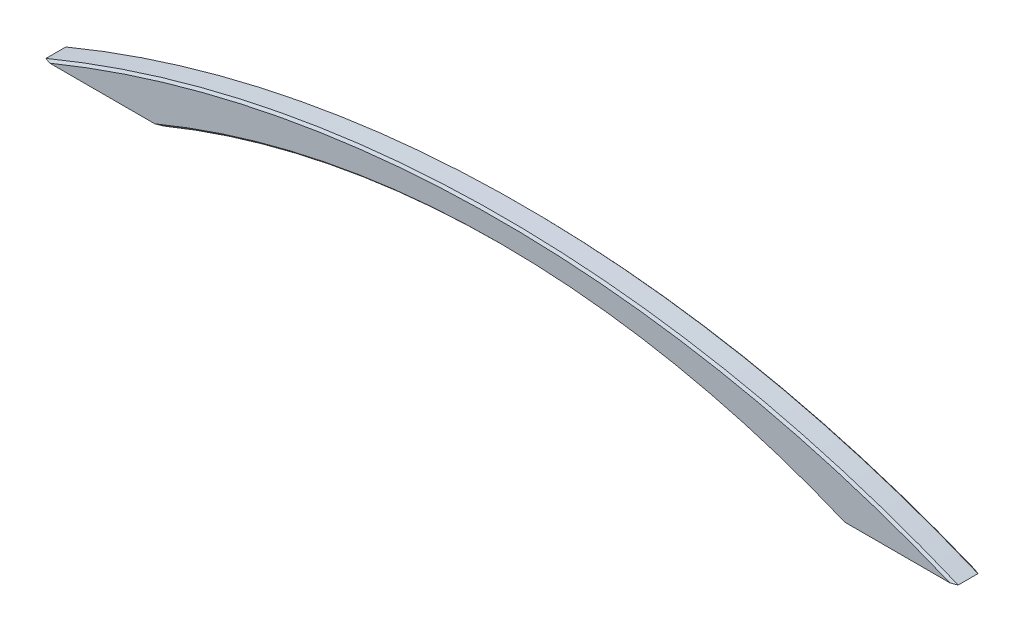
from build123d import *

# Parameters (mm, degrees)
EXTRUDE_1_DEPTH = 4
M4X0_7_1_D      = 3.3
M4X0_7_1_DEPTH  = 6
M4X0_7_1_TIP    = 0.991420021
CHAMFER_1_SIZE  = 0.75


with BuildPart() as part:
    # Sketch 1 → Extrude 1 (new, symmetric)
    with BuildSketch(Plane.XY):
        with BuildLine():
            Line((-111.5, 0), (-150, 0))
            ThreePointArc((-150, 0), (0, 30), (150, 0))
            Line((150, 0), (111.5, 0))
            ThreePointArc((111.5, 0), (0, 22), (-111.5, 0))
        make_face()
    extrude(amount=EXTRUDE_1_DEPTH, both=True)

    # M4x0.7 _1
    with Locations(Plane(origin=(0, 0, 0), x_dir=(-1, 0, 0), z_dir=(0, -1, 0))):
        with Locations((125, 0), (-125, 0)):
            Hole(M4X0_7_1_D / 2, depth=M4X0_7_1_DEPTH)
            with Locations((0, 0, -(M4X0_7_1_DEPTH + M4X0_7_1_TIP / 2))):  # 118° drill point
                Cone(0, M4X0_7_1_D / 2, M4X0_7_1_TIP, mode=Mode.SUBTRACT)

    # Chamfer 1
    chamfer_1_edges = [part.edges().sort_by_distance(p)[0] for p in [
        (0, 30, 4),
        (0, 22, 4),
        (0, 30, -4),
        (0, 22, -4),
    ]]
    chamfer(chamfer_1_edges, length=CHAMFER_1_SIZE)


solid = part.part
